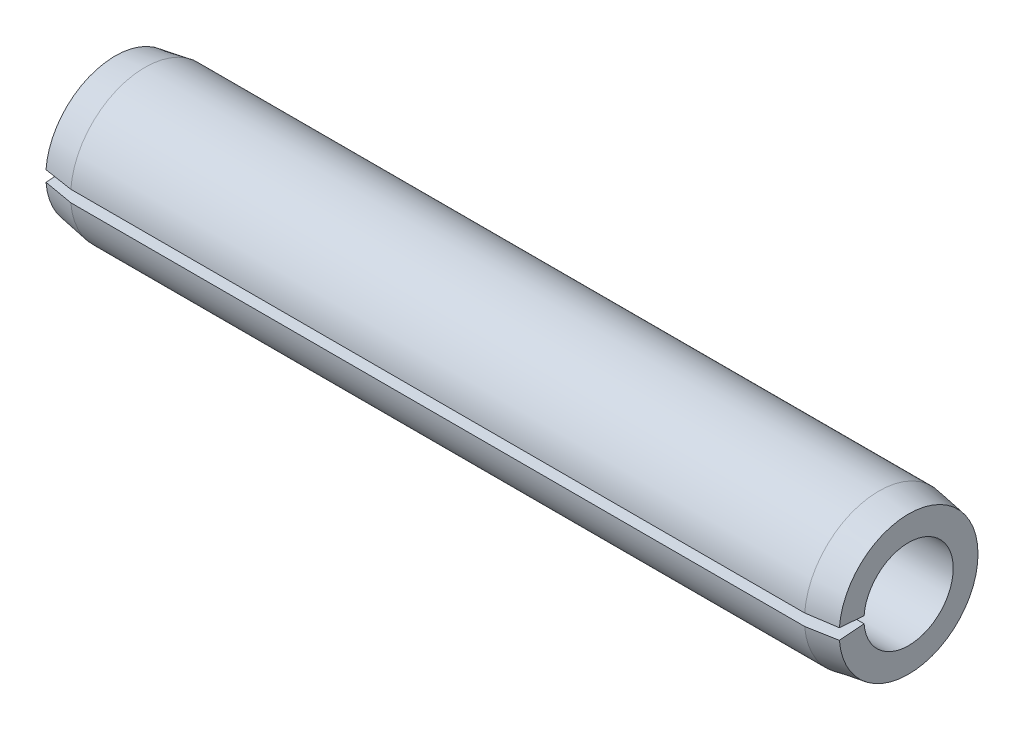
from build123d import *

# Parameters (mm, degrees)
GAP_DEPTH = 103.489078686


with BuildPart() as part:
    # Sketch1 → Base-Revolve (revolve)
    with BuildSketch(Plane.XY, mode=Mode.PRIVATE) as base_revolve_sk:
        Polygon((0, 5.715), (101.6, 5.715), (101.6, 8.89), (97.79, 9.525), (3.81, 9.525), (0, 8.89), align=None)
    revolve(base_revolve_sk.sketch.rotate(Axis((-9.525, 0, 0), (1, 0, 0)), 90), axis=Axis((-9.525, 0, 0), (1, 0, 0)))

    # Sketch2 → Gap (cut, through all)
    with BuildSketch(Plane(origin=(0, 0, 0), x_dir=(0, -1, 0), z_dir=(-1, 0, 0))):
        with BuildLine():
            Line((0, 0), (0.762269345, 9.685550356))
            ThreePointArc((0.762269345, 9.685550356), (0, 9.7155), (-0.762269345, 9.685550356))
            Line((-0.762269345, 9.685550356), (0, 0))
        make_face()
    extrude(amount=-GAP_DEPTH, mode=Mode.SUBTRACT)


solid = part.part
